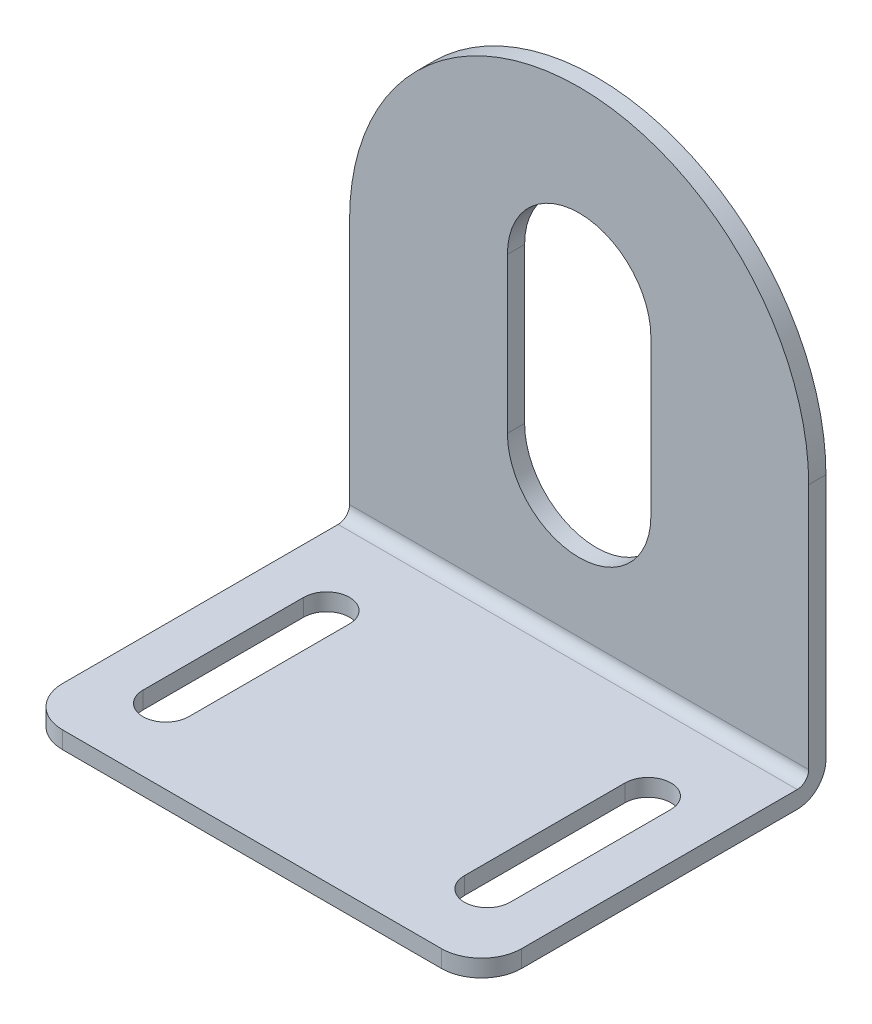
ISO-10303-21;
HEADER;
FILE_DESCRIPTION(('STEP AP214'),'2;1');
FILE_NAME('part.step','',(''),(''),'','','');
FILE_SCHEMA(('AUTOMOTIVE_DESIGN { 1 0 10303 214 1 1 1 1 }'));
ENDSEC;
DATA;
#1=APPLICATION_CONTEXT('core data for automotive mechanical design processes');
#2=APPLICATION_PROTOCOL_DEFINITION('international standard','automotive_design',2000,#1);
#3=PRODUCT_CONTEXT('',#1,'mechanical');
#4=PRODUCT('Part','Part','',(#3));
#5=PRODUCT_RELATED_PRODUCT_CATEGORY('part','',(#4));
#6=PRODUCT_DEFINITION_FORMATION('','',#4);
#7=PRODUCT_DEFINITION_CONTEXT('part definition',#1,'design');
#8=PRODUCT_DEFINITION('design','',#6,#7);
#9=PRODUCT_DEFINITION_SHAPE('','',#8);
#10=(LENGTH_UNIT() NAMED_UNIT(*) SI_UNIT(.MILLI.,.METRE.));
#11=(NAMED_UNIT(*) PLANE_ANGLE_UNIT() SI_UNIT($,.RADIAN.));
#12=(NAMED_UNIT(*) SI_UNIT($,.STERADIAN.) SOLID_ANGLE_UNIT());
#13=UNCERTAINTY_MEASURE_WITH_UNIT(LENGTH_MEASURE(1.E-05),#10,'distance_accuracy_value','');
#14=(GEOMETRIC_REPRESENTATION_CONTEXT(3) GLOBAL_UNCERTAINTY_ASSIGNED_CONTEXT((#13)) GLOBAL_UNIT_ASSIGNED_CONTEXT((#10,
#11,#12)) REPRESENTATION_CONTEXT('',''));
#15=CARTESIAN_POINT('',(0.,0.,0.));
#16=DIRECTION('',(0.,0.,1.));
#17=DIRECTION('',(1.,0.,0.));
#18=AXIS2_PLACEMENT_3D('',#15,#16,#17);
#19=CARTESIAN_POINT('',(20.,0.,0.));
#20=DIRECTION('',(-1.,0.,0.));
#21=DIRECTION('',(0.,0.,1.));
#22=AXIS2_PLACEMENT_3D('',#19,#20,#21);
#23=PLANE('',#22);
#24=DIRECTION('',(0.,0.,-1.));
#25=VECTOR('',#24,1.);
#26=CARTESIAN_POINT('',(20.,0.,30.));
#27=LINE('',#26,#25);
#28=CARTESIAN_POINT('',(20.,0.,25.));
#29=VERTEX_POINT('',#28);
#30=CARTESIAN_POINT('',(20.,0.,1.));
#31=VERTEX_POINT('',#30);
#32=EDGE_CURVE('E364',#29,#31,#27,.T.);
#33=ORIENTED_EDGE('',*,*,#32,.F.);
#34=DIRECTION('',(0.,1.,0.));
#35=VECTOR('',#34,1.);
#36=CARTESIAN_POINT('',(20.,-1.5,25.));
#37=LINE('',#36,#35);
#38=CARTESIAN_POINT('',(20.,-1.5,25.));
#39=VERTEX_POINT('',#38);
#40=EDGE_CURVE('E66',#29,#39,#37,.F.);
#41=ORIENTED_EDGE('',*,*,#40,.T.);
#42=DIRECTION('',(0.,0.,-1.));
#43=VECTOR('',#42,1.);
#44=CARTESIAN_POINT('',(20.,-1.5,30.));
#45=LINE('',#44,#43);
#46=CARTESIAN_POINT('',(20.,-1.5,1.));
#47=VERTEX_POINT('',#46);
#48=EDGE_CURVE('E367',#39,#47,#45,.T.);
#49=ORIENTED_EDGE('',*,*,#48,.T.);
#50=CARTESIAN_POINT('',(20.,1.,1.));
#51=DIRECTION('',(-1.,0.,0.));
#52=DIRECTION('',(0.,0.,1.));
#53=AXIS2_PLACEMENT_3D('',#50,#51,#52);
#54=CIRCLE('',#53,2.5);
#55=CARTESIAN_POINT('',(20.,1.,-1.5));
#56=VERTEX_POINT('',#55);
#57=EDGE_CURVE('E394',#47,#56,#54,.F.);
#58=ORIENTED_EDGE('',*,*,#57,.T.);
#59=DIRECTION('',(0.,1.,0.));
#60=VECTOR('',#59,1.);
#61=CARTESIAN_POINT('',(20.,0.,-1.5));
#62=LINE('',#61,#60);
#63=CARTESIAN_POINT('',(20.,22.5,-1.5));
#64=VERTEX_POINT('',#63);
#65=EDGE_CURVE('E355',#56,#64,#62,.T.);
#66=ORIENTED_EDGE('',*,*,#65,.T.);
#67=DIRECTION('',(0.,0.,-1.));
#68=VECTOR('',#67,1.);
#69=CARTESIAN_POINT('',(20.,22.5,8.5));
#70=LINE('',#69,#68);
#71=CARTESIAN_POINT('',(20.,22.5,0.));
#72=VERTEX_POINT('',#71);
#73=EDGE_CURVE('E346',#72,#64,#70,.T.);
#74=ORIENTED_EDGE('',*,*,#73,.F.);
#75=DIRECTION('',(0.,1.,0.));
#76=VECTOR('',#75,1.);
#77=CARTESIAN_POINT('',(20.,0.,0.));
#78=LINE('',#77,#76);
#79=CARTESIAN_POINT('',(20.,1.,0.));
#80=VERTEX_POINT('',#79);
#81=EDGE_CURVE('E359',#80,#72,#78,.T.);
#82=ORIENTED_EDGE('',*,*,#81,.F.);
#83=CARTESIAN_POINT('',(20.,1.,1.));
#84=DIRECTION('',(-1.,0.,0.));
#85=DIRECTION('',(0.,0.,1.));
#86=AXIS2_PLACEMENT_3D('',#83,#84,#85);
#87=CIRCLE('',#86,1.);
#88=EDGE_CURVE('E407',#80,#31,#87,.T.);
#89=ORIENTED_EDGE('',*,*,#88,.T.);
#90=EDGE_LOOP('',(#33,#41,#49,#58,#66,#74,#82,#89));
#91=FACE_BOUND('',#90,.T.);
#92=ADVANCED_FACE('F42',(#91),#23,.F.);
#93=CARTESIAN_POINT('',(-20.,0.,0.));
#94=DIRECTION('',(-1.,0.,0.));
#95=DIRECTION('',(0.,0.,1.));
#96=AXIS2_PLACEMENT_3D('',#93,#94,#95);
#97=PLANE('',#96);
#98=DIRECTION('',(0.,0.,-1.));
#99=VECTOR('',#98,1.);
#100=CARTESIAN_POINT('',(-20.,-1.5,30.));
#101=LINE('',#100,#99);
#102=CARTESIAN_POINT('',(-20.,-1.5,25.));
#103=VERTEX_POINT('',#102);
#104=CARTESIAN_POINT('',(-20.,-1.5,1.));
#105=VERTEX_POINT('',#104);
#106=EDGE_CURVE('E360',#103,#105,#101,.T.);
#107=ORIENTED_EDGE('',*,*,#106,.F.);
#108=DIRECTION('',(0.,-1.,0.));
#109=VECTOR('',#108,1.);
#110=CARTESIAN_POINT('',(-20.,0.,25.));
#111=LINE('',#110,#109);
#112=CARTESIAN_POINT('',(-20.,0.,25.));
#113=VERTEX_POINT('',#112);
#114=EDGE_CURVE('E11',#103,#113,#111,.F.);
#115=ORIENTED_EDGE('',*,*,#114,.T.);
#116=DIRECTION('',(0.,0.,-1.));
#117=VECTOR('',#116,1.);
#118=CARTESIAN_POINT('',(-20.,0.,30.));
#119=LINE('',#118,#117);
#120=CARTESIAN_POINT('',(-20.,0.,1.));
#121=VERTEX_POINT('',#120);
#122=EDGE_CURVE('E378',#113,#121,#119,.T.);
#123=ORIENTED_EDGE('',*,*,#122,.T.);
#124=CARTESIAN_POINT('',(-20.,1.,1.));
#125=DIRECTION('',(-1.,0.,0.));
#126=DIRECTION('',(0.,0.,1.));
#127=AXIS2_PLACEMENT_3D('',#124,#125,#126);
#128=CIRCLE('',#127,1.);
#129=CARTESIAN_POINT('',(-20.,1.,0.));
#130=VERTEX_POINT('',#129);
#131=EDGE_CURVE('E404',#121,#130,#128,.F.);
#132=ORIENTED_EDGE('',*,*,#131,.T.);
#133=DIRECTION('',(0.,1.,0.));
#134=VECTOR('',#133,1.);
#135=CARTESIAN_POINT('',(-20.,0.,0.));
#136=LINE('',#135,#134);
#137=CARTESIAN_POINT('',(-20.,22.5,0.));
#138=VERTEX_POINT('',#137);
#139=EDGE_CURVE('E374',#130,#138,#136,.T.);
#140=ORIENTED_EDGE('',*,*,#139,.T.);
#141=DIRECTION('',(0.,0.,-1.));
#142=VECTOR('',#141,1.);
#143=CARTESIAN_POINT('',(-20.,22.5,8.5));
#144=LINE('',#143,#142);
#145=CARTESIAN_POINT('',(-20.,22.5,-1.5));
#146=VERTEX_POINT('',#145);
#147=EDGE_CURVE('E411',#138,#146,#144,.T.);
#148=ORIENTED_EDGE('',*,*,#147,.T.);
#149=DIRECTION('',(0.,1.,0.));
#150=VECTOR('',#149,1.);
#151=CARTESIAN_POINT('',(-20.,0.,-1.5));
#152=LINE('',#151,#150);
#153=CARTESIAN_POINT('',(-20.,1.,-1.5));
#154=VERTEX_POINT('',#153);
#155=EDGE_CURVE('E354',#154,#146,#152,.T.);
#156=ORIENTED_EDGE('',*,*,#155,.F.);
#157=CARTESIAN_POINT('',(-20.,1.,1.));
#158=DIRECTION('',(-1.,0.,0.));
#159=DIRECTION('',(0.,0.,1.));
#160=AXIS2_PLACEMENT_3D('',#157,#158,#159);
#161=CIRCLE('',#160,2.5);
#162=EDGE_CURVE('E386',#154,#105,#161,.T.);
#163=ORIENTED_EDGE('',*,*,#162,.T.);
#164=EDGE_LOOP('',(#107,#115,#123,#132,#140,#148,#156,#163));
#165=FACE_BOUND('',#164,.T.);
#166=ADVANCED_FACE('F456',(#165),#97,.T.);
#167=CARTESIAN_POINT('',(20.,0.,30.));
#168=DIRECTION('',(0.,1.,0.));
#169=DIRECTION('',(0.,0.,1.));
#170=AXIS2_PLACEMENT_3D('',#167,#168,#169);
#171=PLANE('',#170);
#172=CARTESIAN_POINT('',(-14.,0.,22.));
#173=DIRECTION('',(0.,-1.,0.));
#174=DIRECTION('',(0.,0.,-1.));
#175=AXIS2_PLACEMENT_3D('',#172,#173,#174);
#176=CIRCLE('',#175,2.);
#177=CARTESIAN_POINT('',(-12.,0.,22.));
#178=VERTEX_POINT('',#177);
#179=CARTESIAN_POINT('',(-16.,0.,22.));
#180=VERTEX_POINT('',#179);
#181=EDGE_CURVE('E196',#178,#180,#176,.T.);
#182=ORIENTED_EDGE('',*,*,#181,.T.);
#183=DIRECTION('',(0.,0.,-1.));
#184=VECTOR('',#183,1.);
#185=CARTESIAN_POINT('',(-16.,0.,22.));
#186=LINE('',#185,#184);
#187=CARTESIAN_POINT('',(-16.,0.,8.));
#188=VERTEX_POINT('',#187);
#189=EDGE_CURVE('E209',#180,#188,#186,.T.);
#190=ORIENTED_EDGE('',*,*,#189,.T.);
#191=CARTESIAN_POINT('',(-14.,0.,8.));
#192=DIRECTION('',(0.,-1.,0.));
#193=DIRECTION('',(0.,0.,-1.));
#194=AXIS2_PLACEMENT_3D('',#191,#192,#193);
#195=CIRCLE('',#194,2.);
#196=CARTESIAN_POINT('',(-12.,0.,8.));
#197=VERTEX_POINT('',#196);
#198=EDGE_CURVE('E214',#188,#197,#195,.T.);
#199=ORIENTED_EDGE('',*,*,#198,.T.);
#200=DIRECTION('',(0.,0.,1.));
#201=VECTOR('',#200,1.);
#202=CARTESIAN_POINT('',(-12.,0.,22.));
#203=LINE('',#202,#201);
#204=EDGE_CURVE('E205',#197,#178,#203,.T.);
#205=ORIENTED_EDGE('',*,*,#204,.T.);
#206=EDGE_LOOP('',(#182,#190,#199,#205));
#207=FACE_BOUND('',#206,.T.);
#208=CARTESIAN_POINT('',(14.,0.,22.));
#209=DIRECTION('',(0.,-1.,0.));
#210=DIRECTION('',(0.,0.,1.));
#211=AXIS2_PLACEMENT_3D('',#208,#209,#210);
#212=CIRCLE('',#211,2.);
#213=CARTESIAN_POINT('',(16.,0.,22.));
#214=VERTEX_POINT('',#213);
#215=CARTESIAN_POINT('',(12.,0.,22.));
#216=VERTEX_POINT('',#215);
#217=EDGE_CURVE('E249',#214,#216,#212,.T.);
#218=ORIENTED_EDGE('',*,*,#217,.T.);
#219=DIRECTION('',(0.,0.,-1.));
#220=VECTOR('',#219,1.);
#221=CARTESIAN_POINT('',(12.,0.,22.));
#222=LINE('',#221,#220);
#223=CARTESIAN_POINT('',(12.,0.,8.));
#224=VERTEX_POINT('',#223);
#225=EDGE_CURVE('E253',#216,#224,#222,.T.);
#226=ORIENTED_EDGE('',*,*,#225,.T.);
#227=CARTESIAN_POINT('',(14.,0.,8.));
#228=DIRECTION('',(0.,-1.,0.));
#229=DIRECTION('',(0.,0.,1.));
#230=AXIS2_PLACEMENT_3D('',#227,#228,#229);
#231=CIRCLE('',#230,2.);
#232=CARTESIAN_POINT('',(16.,0.,8.));
#233=VERTEX_POINT('',#232);
#234=EDGE_CURVE('E258',#224,#233,#231,.T.);
#235=ORIENTED_EDGE('',*,*,#234,.T.);
#236=DIRECTION('',(0.,0.,1.));
#237=VECTOR('',#236,1.);
#238=CARTESIAN_POINT('',(16.,0.,22.));
#239=LINE('',#238,#237);
#240=EDGE_CURVE('E262',#233,#214,#239,.T.);
#241=ORIENTED_EDGE('',*,*,#240,.T.);
#242=EDGE_LOOP('',(#218,#226,#235,#241));
#243=FACE_BOUND('',#242,.T.);
#244=DIRECTION('',(-1.,0.,0.));
#245=VECTOR('',#244,1.);
#246=CARTESIAN_POINT('',(-20.,0.,28.5));
#247=LINE('',#246,#245);
#248=CARTESIAN_POINT('',(16.5,0.,28.5));
#249=VERTEX_POINT('',#248);
#250=CARTESIAN_POINT('',(-16.5,0.,28.5));
#251=VERTEX_POINT('',#250);
#252=EDGE_CURVE('E295',#249,#251,#247,.T.);
#253=ORIENTED_EDGE('',*,*,#252,.F.);
#254=CARTESIAN_POINT('',(16.5,0.,25.));
#255=DIRECTION('',(0.,1.,0.));
#256=DIRECTION('',(0.,0.,1.));
#257=AXIS2_PLACEMENT_3D('',#254,#255,#256);
#258=CIRCLE('',#257,3.5);
#259=EDGE_CURVE('E426',#249,#29,#258,.T.);
#260=ORIENTED_EDGE('',*,*,#259,.T.);
#261=ORIENTED_EDGE('',*,*,#32,.T.);
#262=DIRECTION('',(-1.,0.,0.));
#263=VECTOR('',#262,1.);
#264=CARTESIAN_POINT('',(-20.,0.,1.));
#265=LINE('',#264,#263);
#266=EDGE_CURVE('E397',#31,#121,#265,.T.);
#267=ORIENTED_EDGE('',*,*,#266,.T.);
#268=ORIENTED_EDGE('',*,*,#122,.F.);
#269=CARTESIAN_POINT('',(-16.5,0.,25.));
#270=DIRECTION('',(0.,1.,0.));
#271=DIRECTION('',(0.,0.,1.));
#272=AXIS2_PLACEMENT_3D('',#269,#270,#271);
#273=CIRCLE('',#272,3.5);
#274=EDGE_CURVE('E423',#113,#251,#273,.T.);
#275=ORIENTED_EDGE('',*,*,#274,.T.);
#276=EDGE_LOOP('',(#253,#260,#261,#267,#268,#275));
#277=FACE_BOUND('',#276,.T.);
#278=ADVANCED_FACE('F216',(#207,#243,#277),#171,.T.);
#279=CARTESIAN_POINT('',(20.,-1.5,30.));
#280=DIRECTION('',(0.,1.,0.));
#281=DIRECTION('',(0.,0.,1.));
#282=AXIS2_PLACEMENT_3D('',#279,#280,#281);
#283=PLANE('',#282);
#284=DIRECTION('',(0.,0.,-1.));
#285=VECTOR('',#284,1.);
#286=CARTESIAN_POINT('',(-16.,-1.5,22.));
#287=LINE('',#286,#285);
#288=CARTESIAN_POINT('',(-16.,-1.5,22.));
#289=VERTEX_POINT('',#288);
#290=CARTESIAN_POINT('',(-16.,-1.5,8.));
#291=VERTEX_POINT('',#290);
#292=EDGE_CURVE('E233',#289,#291,#287,.T.);
#293=ORIENTED_EDGE('',*,*,#292,.F.);
#294=CARTESIAN_POINT('',(-14.,-1.5,22.));
#295=DIRECTION('',(0.,-1.,0.));
#296=DIRECTION('',(0.,0.,-1.));
#297=AXIS2_PLACEMENT_3D('',#294,#295,#296);
#298=CIRCLE('',#297,2.);
#299=CARTESIAN_POINT('',(-12.,-1.5,22.));
#300=VERTEX_POINT('',#299);
#301=EDGE_CURVE('E199',#300,#289,#298,.T.);
#302=ORIENTED_EDGE('',*,*,#301,.F.);
#303=DIRECTION('',(0.,0.,1.));
#304=VECTOR('',#303,1.);
#305=CARTESIAN_POINT('',(-12.,-1.5,22.));
#306=LINE('',#305,#304);
#307=CARTESIAN_POINT('',(-12.,-1.5,8.));
#308=VERTEX_POINT('',#307);
#309=EDGE_CURVE('E220',#308,#300,#306,.T.);
#310=ORIENTED_EDGE('',*,*,#309,.F.);
#311=CARTESIAN_POINT('',(-14.,-1.5,8.));
#312=DIRECTION('',(0.,-1.,0.));
#313=DIRECTION('',(0.,0.,-1.));
#314=AXIS2_PLACEMENT_3D('',#311,#312,#313);
#315=CIRCLE('',#314,2.);
#316=EDGE_CURVE('E224',#291,#308,#315,.T.);
#317=ORIENTED_EDGE('',*,*,#316,.F.);
#318=EDGE_LOOP('',(#293,#302,#310,#317));
#319=FACE_BOUND('',#318,.T.);
#320=DIRECTION('',(0.,0.,-1.));
#321=VECTOR('',#320,1.);
#322=CARTESIAN_POINT('',(12.,-1.5,22.));
#323=LINE('',#322,#321);
#324=CARTESIAN_POINT('',(12.,-1.5,22.));
#325=VERTEX_POINT('',#324);
#326=CARTESIAN_POINT('',(12.,-1.5,8.));
#327=VERTEX_POINT('',#326);
#328=EDGE_CURVE('E270',#325,#327,#323,.T.);
#329=ORIENTED_EDGE('',*,*,#328,.F.);
#330=CARTESIAN_POINT('',(14.,-1.5,22.));
#331=DIRECTION('',(0.,-1.,0.));
#332=DIRECTION('',(0.,0.,1.));
#333=AXIS2_PLACEMENT_3D('',#330,#331,#332);
#334=CIRCLE('',#333,2.);
#335=CARTESIAN_POINT('',(16.,-1.5,22.));
#336=VERTEX_POINT('',#335);
#337=EDGE_CURVE('E267',#336,#325,#334,.T.);
#338=ORIENTED_EDGE('',*,*,#337,.F.);
#339=DIRECTION('',(0.,0.,1.));
#340=VECTOR('',#339,1.);
#341=CARTESIAN_POINT('',(16.,-1.5,22.));
#342=LINE('',#341,#340);
#343=CARTESIAN_POINT('',(16.,-1.5,8.));
#344=VERTEX_POINT('',#343);
#345=EDGE_CURVE('E254',#344,#336,#342,.T.);
#346=ORIENTED_EDGE('',*,*,#345,.F.);
#347=CARTESIAN_POINT('',(14.,-1.5,8.));
#348=DIRECTION('',(0.,-1.,0.));
#349=DIRECTION('',(0.,0.,1.));
#350=AXIS2_PLACEMENT_3D('',#347,#348,#349);
#351=CIRCLE('',#350,2.);
#352=EDGE_CURVE('E274',#327,#344,#351,.T.);
#353=ORIENTED_EDGE('',*,*,#352,.F.);
#354=EDGE_LOOP('',(#329,#338,#346,#353));
#355=FACE_BOUND('',#354,.T.);
#356=ORIENTED_EDGE('',*,*,#48,.F.);
#357=CARTESIAN_POINT('',(16.5,-1.5,25.));
#358=DIRECTION('',(0.,1.,0.));
#359=DIRECTION('',(0.,0.,1.));
#360=AXIS2_PLACEMENT_3D('',#357,#358,#359);
#361=CIRCLE('',#360,3.5);
#362=CARTESIAN_POINT('',(16.5,-1.5,28.5));
#363=VERTEX_POINT('',#362);
#364=EDGE_CURVE('E51',#39,#363,#361,.F.);
#365=ORIENTED_EDGE('',*,*,#364,.T.);
#366=DIRECTION('',(1.,0.,0.));
#367=VECTOR('',#366,1.);
#368=CARTESIAN_POINT('',(-20.,-1.5,28.5));
#369=LINE('',#368,#367);
#370=CARTESIAN_POINT('',(-16.5,-1.5,28.5));
#371=VERTEX_POINT('',#370);
#372=EDGE_CURVE('E243',#371,#363,#369,.T.);
#373=ORIENTED_EDGE('',*,*,#372,.F.);
#374=CARTESIAN_POINT('',(-16.5,-1.5,25.));
#375=DIRECTION('',(0.,1.,0.));
#376=DIRECTION('',(0.,0.,1.));
#377=AXIS2_PLACEMENT_3D('',#374,#375,#376);
#378=CIRCLE('',#377,3.5);
#379=EDGE_CURVE('E58',#371,#103,#378,.F.);
#380=ORIENTED_EDGE('',*,*,#379,.T.);
#381=ORIENTED_EDGE('',*,*,#106,.T.);
#382=DIRECTION('',(-1.,0.,0.));
#383=VECTOR('',#382,1.);
#384=CARTESIAN_POINT('',(20.,-1.5,1.));
#385=LINE('',#384,#383);
#386=EDGE_CURVE('E390',#105,#47,#385,.F.);
#387=ORIENTED_EDGE('',*,*,#386,.T.);
#388=EDGE_LOOP('',(#356,#365,#373,#380,#381,#387));
#389=FACE_BOUND('',#388,.T.);
#390=ADVANCED_FACE('F434',(#319,#355,#389),#283,.F.);
#391=CARTESIAN_POINT('',(20.,0.,-1.5));
#392=DIRECTION('',(0.,0.,1.));
#393=DIRECTION('',(1.,0.,0.));
#394=AXIS2_PLACEMENT_3D('',#391,#392,#393);
#395=PLANE('',#394);
#396=CARTESIAN_POINT('',(0.,13.25,-1.5));
#397=DIRECTION('',(0.,0.,1.));
#398=DIRECTION('',(1.,0.,0.));
#399=AXIS2_PLACEMENT_3D('',#396,#397,#398);
#400=CIRCLE('',#399,6.25);
#401=CARTESIAN_POINT('',(-6.25,13.25,-1.5));
#402=VERTEX_POINT('',#401);
#403=CARTESIAN_POINT('',(6.25,13.25,-1.5));
#404=VERTEX_POINT('',#403);
#405=EDGE_CURVE('E335',#402,#404,#400,.T.);
#406=ORIENTED_EDGE('',*,*,#405,.T.);
#407=DIRECTION('',(0.,1.,0.));
#408=VECTOR('',#407,1.);
#409=CARTESIAN_POINT('',(6.25,0.,-1.5));
#410=LINE('',#409,#408);
#411=CARTESIAN_POINT('',(6.25,26.75,-1.5));
#412=VERTEX_POINT('',#411);
#413=EDGE_CURVE('E339',#404,#412,#410,.T.);
#414=ORIENTED_EDGE('',*,*,#413,.T.);
#415=CARTESIAN_POINT('',(0.,26.75,-1.5));
#416=DIRECTION('',(0.,0.,1.));
#417=DIRECTION('',(1.,0.,0.));
#418=AXIS2_PLACEMENT_3D('',#415,#416,#417);
#419=CIRCLE('',#418,6.25);
#420=CARTESIAN_POINT('',(-6.25,26.75,-1.5));
#421=VERTEX_POINT('',#420);
#422=EDGE_CURVE('E318',#412,#421,#419,.T.);
#423=ORIENTED_EDGE('',*,*,#422,.T.);
#424=DIRECTION('',(0.,1.,0.));
#425=VECTOR('',#424,1.);
#426=CARTESIAN_POINT('',(-6.25,0.,-1.5));
#427=LINE('',#426,#425);
#428=EDGE_CURVE('E331',#402,#421,#427,.T.);
#429=ORIENTED_EDGE('',*,*,#428,.F.);
#430=EDGE_LOOP('',(#406,#414,#423,#429));
#431=FACE_BOUND('',#430,.T.);
#432=CARTESIAN_POINT('',(0.,22.5,-1.5));
#433=DIRECTION('',(0.,0.,-1.));
#434=DIRECTION('',(-1.,0.,0.));
#435=AXIS2_PLACEMENT_3D('',#432,#433,#434);
#436=CIRCLE('',#435,20.);
#437=EDGE_CURVE('E343',#146,#64,#436,.T.);
#438=ORIENTED_EDGE('',*,*,#437,.T.);
#439=ORIENTED_EDGE('',*,*,#65,.F.);
#440=DIRECTION('',(-1.,0.,0.));
#441=VECTOR('',#440,1.);
#442=CARTESIAN_POINT('',(20.,1.,-1.5));
#443=LINE('',#442,#441);
#444=EDGE_CURVE('E370',#56,#154,#443,.T.);
#445=ORIENTED_EDGE('',*,*,#444,.T.);
#446=ORIENTED_EDGE('',*,*,#155,.T.);
#447=EDGE_LOOP('',(#438,#439,#445,#446));
#448=FACE_BOUND('',#447,.T.);
#449=ADVANCED_FACE('F465',(#431,#448),#395,.F.);
#450=CARTESIAN_POINT('',(20.,0.,0.));
#451=DIRECTION('',(0.,0.,1.));
#452=DIRECTION('',(1.,0.,0.));
#453=AXIS2_PLACEMENT_3D('',#450,#451,#452);
#454=PLANE('',#453);
#455=DIRECTION('',(0.,1.,0.));
#456=VECTOR('',#455,1.);
#457=CARTESIAN_POINT('',(6.25,13.25,0.));
#458=LINE('',#457,#456);
#459=CARTESIAN_POINT('',(6.25,13.25,0.));
#460=VERTEX_POINT('',#459);
#461=CARTESIAN_POINT('',(6.25,26.75,0.));
#462=VERTEX_POINT('',#461);
#463=EDGE_CURVE('E299',#460,#462,#458,.T.);
#464=ORIENTED_EDGE('',*,*,#463,.F.);
#465=CARTESIAN_POINT('',(0.,13.25,0.));
#466=DIRECTION('',(0.,0.,1.));
#467=DIRECTION('',(1.,0.,0.));
#468=AXIS2_PLACEMENT_3D('',#465,#466,#467);
#469=CIRCLE('',#468,6.25);
#470=CARTESIAN_POINT('',(-6.25,13.25,0.));
#471=VERTEX_POINT('',#470);
#472=EDGE_CURVE('E310',#471,#460,#469,.T.);
#473=ORIENTED_EDGE('',*,*,#472,.F.);
#474=DIRECTION('',(0.,1.,0.));
#475=VECTOR('',#474,1.);
#476=CARTESIAN_POINT('',(-6.25,13.25,0.));
#477=LINE('',#476,#475);
#478=CARTESIAN_POINT('',(-6.25,26.75,0.));
#479=VERTEX_POINT('',#478);
#480=EDGE_CURVE('E306',#471,#479,#477,.T.);
#481=ORIENTED_EDGE('',*,*,#480,.T.);
#482=CARTESIAN_POINT('',(0.,26.75,0.));
#483=DIRECTION('',(0.,0.,1.));
#484=DIRECTION('',(1.,0.,0.));
#485=AXIS2_PLACEMENT_3D('',#482,#483,#484);
#486=CIRCLE('',#485,6.25);
#487=EDGE_CURVE('E302',#462,#479,#486,.T.);
#488=ORIENTED_EDGE('',*,*,#487,.F.);
#489=EDGE_LOOP('',(#464,#473,#481,#488));
#490=FACE_BOUND('',#489,.T.);
#491=ORIENTED_EDGE('',*,*,#81,.T.);
#492=CARTESIAN_POINT('',(0.,22.5,0.));
#493=DIRECTION('',(0.,0.,1.));
#494=DIRECTION('',(1.,0.,0.));
#495=AXIS2_PLACEMENT_3D('',#492,#493,#494);
#496=CIRCLE('',#495,20.);
#497=EDGE_CURVE('E350',#72,#138,#496,.T.);
#498=ORIENTED_EDGE('',*,*,#497,.T.);
#499=ORIENTED_EDGE('',*,*,#139,.F.);
#500=DIRECTION('',(-1.,0.,0.));
#501=VECTOR('',#500,1.);
#502=CARTESIAN_POINT('',(20.,1.,0.));
#503=LINE('',#502,#501);
#504=EDGE_CURVE('E401',#130,#80,#503,.F.);
#505=ORIENTED_EDGE('',*,*,#504,.T.);
#506=EDGE_LOOP('',(#491,#498,#499,#505));
#507=FACE_BOUND('',#506,.T.);
#508=ADVANCED_FACE('F469',(#490,#507),#454,.T.);
#509=CARTESIAN_POINT('',(20.,1.,1.));
#510=DIRECTION('',(-1.,0.,0.));
#511=DIRECTION('',(0.,0.,1.));
#512=AXIS2_PLACEMENT_3D('',#509,#510,#511);
#513=CYLINDRICAL_SURFACE('',#512,2.5);
#514=ORIENTED_EDGE('',*,*,#57,.F.);
#515=ORIENTED_EDGE('',*,*,#386,.F.);
#516=ORIENTED_EDGE('',*,*,#162,.F.);
#517=ORIENTED_EDGE('',*,*,#444,.F.);
#518=EDGE_LOOP('',(#514,#515,#516,#517));
#519=FACE_BOUND('',#518,.T.);
#520=ADVANCED_FACE('F462',(#519),#513,.T.);
#521=CARTESIAN_POINT('',(20.,1.,1.));
#522=DIRECTION('',(1.,0.,0.));
#523=DIRECTION('',(0.,0.,-1.));
#524=AXIS2_PLACEMENT_3D('',#521,#522,#523);
#525=CYLINDRICAL_SURFACE('',#524,1.);
#526=ORIENTED_EDGE('',*,*,#88,.F.);
#527=ORIENTED_EDGE('',*,*,#504,.F.);
#528=ORIENTED_EDGE('',*,*,#131,.F.);
#529=ORIENTED_EDGE('',*,*,#266,.F.);
#530=EDGE_LOOP('',(#526,#527,#528,#529));
#531=FACE_BOUND('',#530,.T.);
#532=ADVANCED_FACE('F450',(#531),#525,.F.);
#533=CARTESIAN_POINT('',(0.,22.5,8.5));
#534=DIRECTION('',(0.,0.,-1.));
#535=DIRECTION('',(-1.,0.,0.));
#536=AXIS2_PLACEMENT_3D('',#533,#534,#535);
#537=CYLINDRICAL_SURFACE('',#536,20.);
#538=ORIENTED_EDGE('',*,*,#497,.F.);
#539=ORIENTED_EDGE('',*,*,#73,.T.);
#540=ORIENTED_EDGE('',*,*,#437,.F.);
#541=ORIENTED_EDGE('',*,*,#147,.F.);
#542=EDGE_LOOP('',(#538,#539,#540,#541));
#543=FACE_BOUND('',#542,.T.);
#544=ADVANCED_FACE('F467',(#543),#537,.T.);
#545=CARTESIAN_POINT('',(6.25,13.25,-10.));
#546=DIRECTION('',(1.,0.,0.));
#547=DIRECTION('',(0.,0.,-1.));
#548=AXIS2_PLACEMENT_3D('',#545,#546,#547);
#549=PLANE('',#548);
#550=DIRECTION('',(0.,0.,1.));
#551=VECTOR('',#550,1.);
#552=CARTESIAN_POINT('',(6.25,13.25,-10.));
#553=LINE('',#552,#551);
#554=EDGE_CURVE('E315',#404,#460,#553,.T.);
#555=ORIENTED_EDGE('',*,*,#554,.T.);
#556=ORIENTED_EDGE('',*,*,#463,.T.);
#557=DIRECTION('',(0.,0.,1.));
#558=VECTOR('',#557,1.);
#559=CARTESIAN_POINT('',(6.25,26.75,-10.));
#560=LINE('',#559,#558);
#561=EDGE_CURVE('E314',#412,#462,#560,.T.);
#562=ORIENTED_EDGE('',*,*,#561,.F.);
#563=ORIENTED_EDGE('',*,*,#413,.F.);
#564=EDGE_LOOP('',(#555,#556,#562,#563));
#565=FACE_BOUND('',#564,.T.);
#566=ADVANCED_FACE('F535',(#565),#549,.F.);
#567=CARTESIAN_POINT('',(0.,13.25,-10.));
#568=DIRECTION('',(0.,0.,1.));
#569=DIRECTION('',(1.,0.,0.));
#570=AXIS2_PLACEMENT_3D('',#567,#568,#569);
#571=CYLINDRICAL_SURFACE('',#570,6.25);
#572=DIRECTION('',(0.,0.,1.));
#573=VECTOR('',#572,1.);
#574=CARTESIAN_POINT('',(-6.25,13.25,-10.));
#575=LINE('',#574,#573);
#576=EDGE_CURVE('E319',#402,#471,#575,.T.);
#577=ORIENTED_EDGE('',*,*,#576,.T.);
#578=ORIENTED_EDGE('',*,*,#472,.T.);
#579=ORIENTED_EDGE('',*,*,#554,.F.);
#580=ORIENTED_EDGE('',*,*,#405,.F.);
#581=EDGE_LOOP('',(#577,#578,#579,#580));
#582=FACE_BOUND('',#581,.T.);
#583=ADVANCED_FACE('F542',(#582),#571,.F.);
#584=CARTESIAN_POINT('',(-6.25,13.25,-10.));
#585=DIRECTION('',(1.,0.,0.));
#586=DIRECTION('',(0.,0.,-1.));
#587=AXIS2_PLACEMENT_3D('',#584,#585,#586);
#588=PLANE('',#587);
#589=ORIENTED_EDGE('',*,*,#428,.T.);
#590=DIRECTION('',(0.,0.,1.));
#591=VECTOR('',#590,1.);
#592=CARTESIAN_POINT('',(-6.25,26.75,-10.));
#593=LINE('',#592,#591);
#594=EDGE_CURVE('E322',#421,#479,#593,.T.);
#595=ORIENTED_EDGE('',*,*,#594,.T.);
#596=ORIENTED_EDGE('',*,*,#480,.F.);
#597=ORIENTED_EDGE('',*,*,#576,.F.);
#598=EDGE_LOOP('',(#589,#595,#596,#597));
#599=FACE_BOUND('',#598,.T.);
#600=ADVANCED_FACE('F551',(#599),#588,.T.);
#601=CARTESIAN_POINT('',(0.,26.75,-10.));
#602=DIRECTION('',(0.,0.,1.));
#603=DIRECTION('',(1.,0.,0.));
#604=AXIS2_PLACEMENT_3D('',#601,#602,#603);
#605=CYLINDRICAL_SURFACE('',#604,6.25);
#606=ORIENTED_EDGE('',*,*,#561,.T.);
#607=ORIENTED_EDGE('',*,*,#487,.T.);
#608=ORIENTED_EDGE('',*,*,#594,.F.);
#609=ORIENTED_EDGE('',*,*,#422,.F.);
#610=EDGE_LOOP('',(#606,#607,#608,#609));
#611=FACE_BOUND('',#610,.T.);
#612=ADVANCED_FACE('F561',(#611),#605,.F.);
#613=CARTESIAN_POINT('',(0.,0.,28.5));
#614=DIRECTION('',(0.,0.,1.));
#615=DIRECTION('',(1.,0.,0.));
#616=AXIS2_PLACEMENT_3D('',#613,#614,#615);
#617=PLANE('',#616);
#618=ORIENTED_EDGE('',*,*,#372,.T.);
#619=DIRECTION('',(0.,1.,0.));
#620=VECTOR('',#619,1.);
#621=CARTESIAN_POINT('',(16.5,0.,28.5));
#622=LINE('',#621,#620);
#623=EDGE_CURVE('E419',#363,#249,#622,.T.);
#624=ORIENTED_EDGE('',*,*,#623,.T.);
#625=ORIENTED_EDGE('',*,*,#252,.T.);
#626=DIRECTION('',(0.,-1.,0.));
#627=VECTOR('',#626,1.);
#628=CARTESIAN_POINT('',(-16.5,0.,28.5));
#629=LINE('',#628,#627);
#630=EDGE_CURVE('E415',#251,#371,#629,.T.);
#631=ORIENTED_EDGE('',*,*,#630,.T.);
#632=EDGE_LOOP('',(#618,#624,#625,#631));
#633=FACE_BOUND('',#632,.T.);
#634=ADVANCED_FACE('F438',(#633),#617,.T.);
#635=CARTESIAN_POINT('',(14.,0.,22.));
#636=DIRECTION('',(0.,-1.,0.));
#637=DIRECTION('',(0.,0.,-1.));
#638=AXIS2_PLACEMENT_3D('',#635,#636,#637);
#639=CYLINDRICAL_SURFACE('',#638,2.);
#640=ORIENTED_EDGE('',*,*,#337,.T.);
#641=DIRECTION('',(0.,-1.,0.));
#642=VECTOR('',#641,1.);
#643=CARTESIAN_POINT('',(12.,0.,22.));
#644=LINE('',#643,#642);
#645=EDGE_CURVE('E266',#216,#325,#644,.T.);
#646=ORIENTED_EDGE('',*,*,#645,.F.);
#647=ORIENTED_EDGE('',*,*,#217,.F.);
#648=DIRECTION('',(0.,-1.,0.));
#649=VECTOR('',#648,1.);
#650=CARTESIAN_POINT('',(16.,0.,22.));
#651=LINE('',#650,#649);
#652=EDGE_CURVE('E234',#214,#336,#651,.T.);
#653=ORIENTED_EDGE('',*,*,#652,.T.);
#654=EDGE_LOOP('',(#640,#646,#647,#653));
#655=FACE_BOUND('',#654,.T.);
#656=ADVANCED_FACE('F581',(#655),#639,.F.);
#657=CARTESIAN_POINT('',(16.,0.,22.));
#658=DIRECTION('',(1.,0.,0.));
#659=DIRECTION('',(0.,0.,-1.));
#660=AXIS2_PLACEMENT_3D('',#657,#658,#659);
#661=PLANE('',#660);
#662=ORIENTED_EDGE('',*,*,#345,.T.);
#663=ORIENTED_EDGE('',*,*,#652,.F.);
#664=ORIENTED_EDGE('',*,*,#240,.F.);
#665=DIRECTION('',(0.,-1.,0.));
#666=VECTOR('',#665,1.);
#667=CARTESIAN_POINT('',(16.,0.,8.));
#668=LINE('',#667,#666);
#669=EDGE_CURVE('E283',#233,#344,#668,.T.);
#670=ORIENTED_EDGE('',*,*,#669,.T.);
#671=EDGE_LOOP('',(#662,#663,#664,#670));
#672=FACE_BOUND('',#671,.T.);
#673=ADVANCED_FACE('F590',(#672),#661,.F.);
#674=CARTESIAN_POINT('',(14.,0.,8.));
#675=DIRECTION('',(0.,-1.,0.));
#676=DIRECTION('',(0.,0.,-1.));
#677=AXIS2_PLACEMENT_3D('',#674,#675,#676);
#678=CYLINDRICAL_SURFACE('',#677,2.);
#679=ORIENTED_EDGE('',*,*,#352,.T.);
#680=ORIENTED_EDGE('',*,*,#669,.F.);
#681=ORIENTED_EDGE('',*,*,#234,.F.);
#682=DIRECTION('',(0.,-1.,0.));
#683=VECTOR('',#682,1.);
#684=CARTESIAN_POINT('',(12.,0.,8.));
#685=LINE('',#684,#683);
#686=EDGE_CURVE('E286',#224,#327,#685,.T.);
#687=ORIENTED_EDGE('',*,*,#686,.T.);
#688=EDGE_LOOP('',(#679,#680,#681,#687));
#689=FACE_BOUND('',#688,.T.);
#690=ADVANCED_FACE('F600',(#689),#678,.F.);
#691=CARTESIAN_POINT('',(12.,0.,22.));
#692=DIRECTION('',(-1.,0.,0.));
#693=DIRECTION('',(0.,0.,1.));
#694=AXIS2_PLACEMENT_3D('',#691,#692,#693);
#695=PLANE('',#694);
#696=ORIENTED_EDGE('',*,*,#328,.T.);
#697=ORIENTED_EDGE('',*,*,#686,.F.);
#698=ORIENTED_EDGE('',*,*,#225,.F.);
#699=ORIENTED_EDGE('',*,*,#645,.T.);
#700=EDGE_LOOP('',(#696,#697,#698,#699));
#701=FACE_BOUND('',#700,.T.);
#702=ADVANCED_FACE('F610',(#701),#695,.F.);
#703=CARTESIAN_POINT('',(-14.,0.,22.));
#704=DIRECTION('',(0.,-1.,0.));
#705=DIRECTION('',(0.,0.,-1.));
#706=AXIS2_PLACEMENT_3D('',#703,#704,#705);
#707=CYLINDRICAL_SURFACE('',#706,2.);
#708=ORIENTED_EDGE('',*,*,#301,.T.);
#709=DIRECTION('',(0.,-1.,0.));
#710=VECTOR('',#709,1.);
#711=CARTESIAN_POINT('',(-16.,0.,22.));
#712=LINE('',#711,#710);
#713=EDGE_CURVE('E192',#180,#289,#712,.T.);
#714=ORIENTED_EDGE('',*,*,#713,.F.);
#715=ORIENTED_EDGE('',*,*,#181,.F.);
#716=DIRECTION('',(0.,-1.,0.));
#717=VECTOR('',#716,1.);
#718=CARTESIAN_POINT('',(-12.,0.,22.));
#719=LINE('',#718,#717);
#720=EDGE_CURVE('E240',#178,#300,#719,.T.);
#721=ORIENTED_EDGE('',*,*,#720,.T.);
#722=EDGE_LOOP('',(#708,#714,#715,#721));
#723=FACE_BOUND('',#722,.T.);
#724=ADVANCED_FACE('F194',(#723),#707,.F.);
#725=CARTESIAN_POINT('',(-12.,0.,22.));
#726=DIRECTION('',(1.,0.,0.));
#727=DIRECTION('',(0.,0.,-1.));
#728=AXIS2_PLACEMENT_3D('',#725,#726,#727);
#729=PLANE('',#728);
#730=ORIENTED_EDGE('',*,*,#309,.T.);
#731=ORIENTED_EDGE('',*,*,#720,.F.);
#732=ORIENTED_EDGE('',*,*,#204,.F.);
#733=DIRECTION('',(0.,-1.,0.));
#734=VECTOR('',#733,1.);
#735=CARTESIAN_POINT('',(-12.,0.,8.));
#736=LINE('',#735,#734);
#737=EDGE_CURVE('E244',#197,#308,#736,.T.);
#738=ORIENTED_EDGE('',*,*,#737,.T.);
#739=EDGE_LOOP('',(#730,#731,#732,#738));
#740=FACE_BOUND('',#739,.T.);
#741=ADVANCED_FACE('F629',(#740),#729,.F.);
#742=CARTESIAN_POINT('',(-14.,0.,8.));
#743=DIRECTION('',(0.,-1.,0.));
#744=DIRECTION('',(0.,0.,-1.));
#745=AXIS2_PLACEMENT_3D('',#742,#743,#744);
#746=CYLINDRICAL_SURFACE('',#745,2.);
#747=ORIENTED_EDGE('',*,*,#316,.T.);
#748=ORIENTED_EDGE('',*,*,#737,.F.);
#749=ORIENTED_EDGE('',*,*,#198,.F.);
#750=DIRECTION('',(0.,-1.,0.));
#751=VECTOR('',#750,1.);
#752=CARTESIAN_POINT('',(-16.,0.,8.));
#753=LINE('',#752,#751);
#754=EDGE_CURVE('E204',#188,#291,#753,.T.);
#755=ORIENTED_EDGE('',*,*,#754,.T.);
#756=EDGE_LOOP('',(#747,#748,#749,#755));
#757=FACE_BOUND('',#756,.T.);
#758=ADVANCED_FACE('F638',(#757),#746,.F.);
#759=CARTESIAN_POINT('',(-16.,0.,22.));
#760=DIRECTION('',(-1.,0.,0.));
#761=DIRECTION('',(0.,0.,1.));
#762=AXIS2_PLACEMENT_3D('',#759,#760,#761);
#763=PLANE('',#762);
#764=ORIENTED_EDGE('',*,*,#292,.T.);
#765=ORIENTED_EDGE('',*,*,#754,.F.);
#766=ORIENTED_EDGE('',*,*,#189,.F.);
#767=ORIENTED_EDGE('',*,*,#713,.T.);
#768=EDGE_LOOP('',(#764,#765,#766,#767));
#769=FACE_BOUND('',#768,.T.);
#770=ADVANCED_FACE('F210',(#769),#763,.F.);
#771=CARTESIAN_POINT('',(16.5,0.,25.));
#772=DIRECTION('',(0.,-1.,0.));
#773=DIRECTION('',(0.,0.,-1.));
#774=AXIS2_PLACEMENT_3D('',#771,#772,#773);
#775=CYLINDRICAL_SURFACE('',#774,3.5);
#776=ORIENTED_EDGE('',*,*,#364,.F.);
#777=ORIENTED_EDGE('',*,*,#40,.F.);
#778=ORIENTED_EDGE('',*,*,#259,.F.);
#779=ORIENTED_EDGE('',*,*,#623,.F.);
#780=EDGE_LOOP('',(#776,#777,#778,#779));
#781=FACE_BOUND('',#780,.T.);
#782=ADVANCED_FACE('F441',(#781),#775,.T.);
#783=CARTESIAN_POINT('',(-16.5,0.,25.));
#784=DIRECTION('',(0.,-1.,0.));
#785=DIRECTION('',(0.,0.,-1.));
#786=AXIS2_PLACEMENT_3D('',#783,#784,#785);
#787=CYLINDRICAL_SURFACE('',#786,3.5);
#788=ORIENTED_EDGE('',*,*,#274,.F.);
#789=ORIENTED_EDGE('',*,*,#114,.F.);
#790=ORIENTED_EDGE('',*,*,#379,.F.);
#791=ORIENTED_EDGE('',*,*,#630,.F.);
#792=EDGE_LOOP('',(#788,#789,#790,#791));
#793=FACE_BOUND('',#792,.T.);
#794=ADVANCED_FACE('F44',(#793),#787,.T.);
#795=CLOSED_SHELL('',(#92,#166,#278,#390,#449,#508,#520,#532,#544,#566,#583,#600,#612,#634,#656,
#673,#690,#702,#724,#741,#758,#770,#782,#794));
#796=MANIFOLD_SOLID_BREP('B2',#795);
#797=ADVANCED_BREP_SHAPE_REPRESENTATION('',(#18,#796),#14);
#798=SHAPE_DEFINITION_REPRESENTATION(#9,#797);
ENDSEC;
END-ISO-10303-21;
